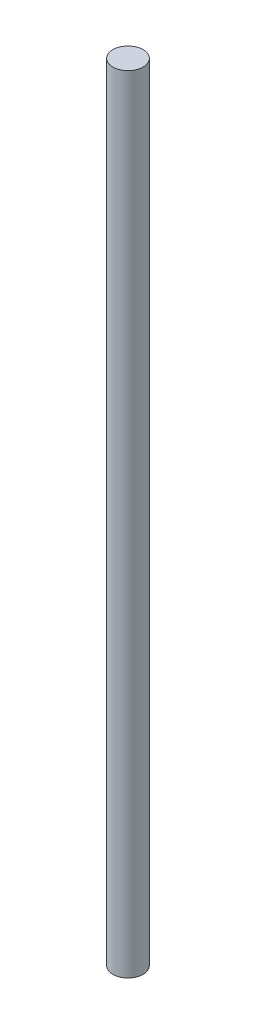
from build123d import *

# Parameters (mm, degrees)
SKETCH1_R      = 3.175
EXTRUDE1_DEPTH = 165.1


with BuildPart() as part:
    # Sketch1 → Extrude1 (new body)
    with BuildSketch(Plane(origin=(0, 0, 0), x_dir=(1, 0, 0), z_dir=(0, 1, 0))):
        with Locations(Location((0, 0, 0), (0, 0, 270))):
            Circle(SKETCH1_R)
    extrude(amount=EXTRUDE1_DEPTH)


solid = part.part
